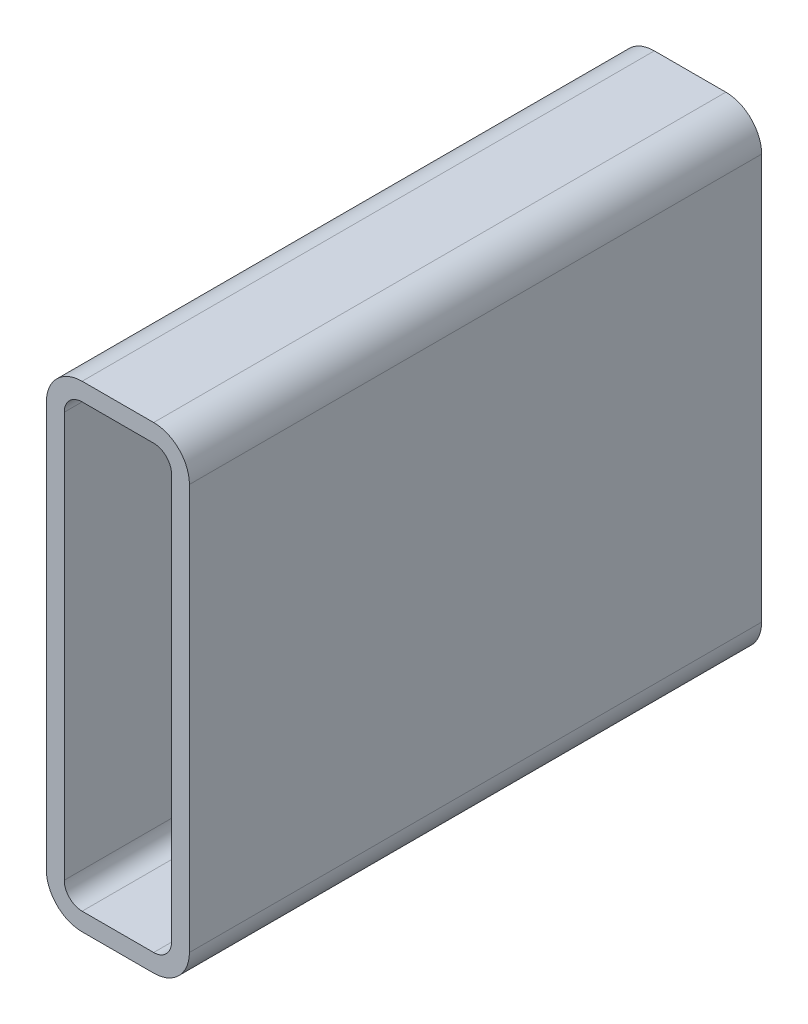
ISO-10303-21;
HEADER;
FILE_DESCRIPTION(('STEP AP214'),'2;1');
FILE_NAME('part.step','',(''),(''),'','','');
FILE_SCHEMA(('AUTOMOTIVE_DESIGN { 1 0 10303 214 1 1 1 1 }'));
ENDSEC;
DATA;
#1=APPLICATION_CONTEXT('core data for automotive mechanical design processes');
#2=APPLICATION_PROTOCOL_DEFINITION('international standard','automotive_design',2000,#1);
#3=PRODUCT_CONTEXT('',#1,'mechanical');
#4=PRODUCT('Part','Part','',(#3));
#5=PRODUCT_RELATED_PRODUCT_CATEGORY('part','',(#4));
#6=PRODUCT_DEFINITION_FORMATION('','',#4);
#7=PRODUCT_DEFINITION_CONTEXT('part definition',#1,'design');
#8=PRODUCT_DEFINITION('design','',#6,#7);
#9=PRODUCT_DEFINITION_SHAPE('','',#8);
#10=(LENGTH_UNIT() NAMED_UNIT(*) SI_UNIT(.MILLI.,.METRE.));
#11=(NAMED_UNIT(*) PLANE_ANGLE_UNIT() SI_UNIT($,.RADIAN.));
#12=(NAMED_UNIT(*) SI_UNIT($,.STERADIAN.) SOLID_ANGLE_UNIT());
#13=UNCERTAINTY_MEASURE_WITH_UNIT(LENGTH_MEASURE(1.E-05),#10,'distance_accuracy_value','');
#14=(GEOMETRIC_REPRESENTATION_CONTEXT(3) GLOBAL_UNCERTAINTY_ASSIGNED_CONTEXT((#13)) GLOBAL_UNIT_ASSIGNED_CONTEXT((#10,
#11,#12)) REPRESENTATION_CONTEXT('',''));
#15=CARTESIAN_POINT('',(0.,0.,0.));
#16=DIRECTION('',(0.,0.,1.));
#17=DIRECTION('',(1.,0.,0.));
#18=AXIS2_PLACEMENT_3D('',#15,#16,#17);
#19=CARTESIAN_POINT('',(21.5391160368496,236.870313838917,304.8));
#20=DIRECTION('',(0.,0.,1.));
#21=DIRECTION('',(1.,0.,0.));
#22=AXIS2_PLACEMENT_3D('',#19,#20,#21);
#23=PLANE('',#22);
#24=CARTESIAN_POINT('',(21.5391160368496,236.870313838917,304.8));
#25=DIRECTION('',(0.,0.,1.));
#26=DIRECTION('',(1.,0.,0.));
#27=AXIS2_PLACEMENT_3D('',#24,#25,#26);
#28=CIRCLE('',#27,19.05);
#29=CARTESIAN_POINT('',(21.5391160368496,255.920313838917,304.8));
#30=VERTEX_POINT('',#29);
#31=CARTESIAN_POINT('',(2.48911603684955,236.870313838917,304.8));
#32=VERTEX_POINT('',#31);
#33=EDGE_CURVE('E211',#30,#32,#28,.T.);
#34=ORIENTED_EDGE('',*,*,#33,.T.);
#35=DIRECTION('',(0.,-1.,0.));
#36=VECTOR('',#35,1.);
#37=CARTESIAN_POINT('',(2.48911603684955,20.9703138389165,304.8));
#38=LINE('',#37,#36);
#39=CARTESIAN_POINT('',(2.48911603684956,20.9703138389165,304.8));
#40=VERTEX_POINT('',#39);
#41=EDGE_CURVE('E214',#32,#40,#38,.T.);
#42=ORIENTED_EDGE('',*,*,#41,.T.);
#43=CARTESIAN_POINT('',(21.5391160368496,20.9703138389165,304.8));
#44=DIRECTION('',(0.,0.,1.));
#45=DIRECTION('',(1.,0.,0.));
#46=AXIS2_PLACEMENT_3D('',#43,#44,#45);
#47=CIRCLE('',#46,19.05);
#48=CARTESIAN_POINT('',(21.5391160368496,1.92031383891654,304.8));
#49=VERTEX_POINT('',#48);
#50=EDGE_CURVE('E217',#40,#49,#47,.T.);
#51=ORIENTED_EDGE('',*,*,#50,.T.);
#52=DIRECTION('',(1.,0.,0.));
#53=VECTOR('',#52,1.);
#54=CARTESIAN_POINT('',(59.6391160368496,1.92031383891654,304.8));
#55=LINE('',#54,#53);
#56=CARTESIAN_POINT('',(59.6391160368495,1.92031383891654,304.8));
#57=VERTEX_POINT('',#56);
#58=EDGE_CURVE('E219',#49,#57,#55,.T.);
#59=ORIENTED_EDGE('',*,*,#58,.T.);
#60=CARTESIAN_POINT('',(59.6391160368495,20.9703138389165,304.8));
#61=DIRECTION('',(0.,0.,1.));
#62=DIRECTION('',(1.,0.,0.));
#63=AXIS2_PLACEMENT_3D('',#60,#61,#62);
#64=CIRCLE('',#63,19.05);
#65=CARTESIAN_POINT('',(78.6891160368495,20.9703138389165,304.8));
#66=VERTEX_POINT('',#65);
#67=EDGE_CURVE('E221',#57,#66,#64,.T.);
#68=ORIENTED_EDGE('',*,*,#67,.T.);
#69=DIRECTION('',(0.,1.,0.));
#70=VECTOR('',#69,1.);
#71=CARTESIAN_POINT('',(78.6891160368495,236.870313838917,304.8));
#72=LINE('',#71,#70);
#73=CARTESIAN_POINT('',(78.6891160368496,236.870313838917,304.8));
#74=VERTEX_POINT('',#73);
#75=EDGE_CURVE('E223',#66,#74,#72,.T.);
#76=ORIENTED_EDGE('',*,*,#75,.T.);
#77=CARTESIAN_POINT('',(59.6391160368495,236.870313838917,304.8));
#78=DIRECTION('',(0.,0.,1.));
#79=DIRECTION('',(1.,0.,0.));
#80=AXIS2_PLACEMENT_3D('',#77,#78,#79);
#81=CIRCLE('',#80,19.05);
#82=CARTESIAN_POINT('',(59.6391160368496,255.920313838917,304.8));
#83=VERTEX_POINT('',#82);
#84=EDGE_CURVE('E225',#74,#83,#81,.T.);
#85=ORIENTED_EDGE('',*,*,#84,.T.);
#86=DIRECTION('',(-1.,0.,0.));
#87=VECTOR('',#86,1.);
#88=CARTESIAN_POINT('',(21.5391160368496,255.920313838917,304.8));
#89=LINE('',#88,#87);
#90=EDGE_CURVE('E227',#83,#30,#89,.T.);
#91=ORIENTED_EDGE('',*,*,#90,.T.);
#92=EDGE_LOOP('',(#34,#42,#51,#59,#68,#76,#85,#91));
#93=FACE_BOUND('',#92,.T.);
#94=DIRECTION('',(0.,-1.,0.));
#95=VECTOR('',#94,1.);
#96=CARTESIAN_POINT('',(12.0141160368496,20.9703138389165,304.8));
#97=LINE('',#96,#95);
#98=CARTESIAN_POINT('',(12.0141160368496,236.870313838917,304.8));
#99=VERTEX_POINT('',#98);
#100=CARTESIAN_POINT('',(12.0141160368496,20.9703138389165,304.8));
#101=VERTEX_POINT('',#100);
#102=EDGE_CURVE('E154',#99,#101,#97,.T.);
#103=ORIENTED_EDGE('',*,*,#102,.F.);
#104=CARTESIAN_POINT('',(21.5391160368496,236.870313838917,304.8));
#105=DIRECTION('',(0.,0.,1.));
#106=DIRECTION('',(1.,0.,0.));
#107=AXIS2_PLACEMENT_3D('',#104,#105,#106);
#108=CIRCLE('',#107,9.52500000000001);
#109=CARTESIAN_POINT('',(21.5391160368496,246.395313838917,304.8));
#110=VERTEX_POINT('',#109);
#111=EDGE_CURVE('E146',#110,#99,#108,.T.);
#112=ORIENTED_EDGE('',*,*,#111,.F.);
#113=DIRECTION('',(-1.,0.,0.));
#114=VECTOR('',#113,1.);
#115=CARTESIAN_POINT('',(21.5391160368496,246.395313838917,304.8));
#116=LINE('',#115,#114);
#117=CARTESIAN_POINT('',(59.6391160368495,246.395313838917,304.8));
#118=VERTEX_POINT('',#117);
#119=EDGE_CURVE('E179',#118,#110,#116,.T.);
#120=ORIENTED_EDGE('',*,*,#119,.F.);
#121=CARTESIAN_POINT('',(59.6391160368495,236.870313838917,304.8));
#122=DIRECTION('',(0.,0.,1.));
#123=DIRECTION('',(1.,0.,0.));
#124=AXIS2_PLACEMENT_3D('',#121,#122,#123);
#125=CIRCLE('',#124,9.52500000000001);
#126=CARTESIAN_POINT('',(69.1641160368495,236.870313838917,304.8));
#127=VERTEX_POINT('',#126);
#128=EDGE_CURVE('E177',#127,#118,#125,.T.);
#129=ORIENTED_EDGE('',*,*,#128,.F.);
#130=DIRECTION('',(0.,1.,0.));
#131=VECTOR('',#130,1.);
#132=CARTESIAN_POINT('',(69.1641160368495,236.870313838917,304.8));
#133=LINE('',#132,#131);
#134=CARTESIAN_POINT('',(69.1641160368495,20.9703138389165,304.8));
#135=VERTEX_POINT('',#134);
#136=EDGE_CURVE('E175',#135,#127,#133,.T.);
#137=ORIENTED_EDGE('',*,*,#136,.F.);
#138=CARTESIAN_POINT('',(59.6391160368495,20.9703138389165,304.8));
#139=DIRECTION('',(0.,0.,1.));
#140=DIRECTION('',(1.,0.,0.));
#141=AXIS2_PLACEMENT_3D('',#138,#139,#140);
#142=CIRCLE('',#141,9.525);
#143=CARTESIAN_POINT('',(59.6391160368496,11.4453138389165,304.8));
#144=VERTEX_POINT('',#143);
#145=EDGE_CURVE('E173',#144,#135,#142,.T.);
#146=ORIENTED_EDGE('',*,*,#145,.F.);
#147=DIRECTION('',(1.,0.,0.));
#148=VECTOR('',#147,1.);
#149=CARTESIAN_POINT('',(59.6391160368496,11.4453138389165,304.8));
#150=LINE('',#149,#148);
#151=CARTESIAN_POINT('',(21.5391160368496,11.4453138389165,304.8));
#152=VERTEX_POINT('',#151);
#153=EDGE_CURVE('E169',#152,#144,#150,.T.);
#154=ORIENTED_EDGE('',*,*,#153,.F.);
#155=CARTESIAN_POINT('',(21.5391160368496,20.9703138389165,304.8));
#156=DIRECTION('',(0.,0.,1.));
#157=DIRECTION('',(1.,0.,0.));
#158=AXIS2_PLACEMENT_3D('',#155,#156,#157);
#159=CIRCLE('',#158,9.525);
#160=EDGE_CURVE('E167',#101,#152,#159,.T.);
#161=ORIENTED_EDGE('',*,*,#160,.F.);
#162=EDGE_LOOP('',(#103,#112,#120,#129,#137,#146,#154,#161));
#163=FACE_BOUND('',#162,.T.);
#164=ADVANCED_FACE('F33',(#93,#163),#23,.T.);
#165=CARTESIAN_POINT('',(21.5391160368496,236.870313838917,0.));
#166=DIRECTION('',(0.,0.,1.));
#167=DIRECTION('',(1.,0.,0.));
#168=AXIS2_PLACEMENT_3D('',#165,#166,#167);
#169=PLANE('',#168);
#170=CARTESIAN_POINT('',(21.5391160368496,236.870313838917,0.));
#171=DIRECTION('',(0.,0.,1.));
#172=DIRECTION('',(1.,0.,0.));
#173=AXIS2_PLACEMENT_3D('',#170,#171,#172);
#174=CIRCLE('',#173,19.05);
#175=CARTESIAN_POINT('',(21.5391160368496,255.920313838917,0.));
#176=VERTEX_POINT('',#175);
#177=CARTESIAN_POINT('',(2.48911603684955,236.870313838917,0.));
#178=VERTEX_POINT('',#177);
#179=EDGE_CURVE('E162',#176,#178,#174,.T.);
#180=ORIENTED_EDGE('',*,*,#179,.F.);
#181=DIRECTION('',(-1.,0.,0.));
#182=VECTOR('',#181,1.);
#183=CARTESIAN_POINT('',(21.5391160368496,255.920313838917,0.));
#184=LINE('',#183,#182);
#185=CARTESIAN_POINT('',(59.6391160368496,255.920313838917,0.));
#186=VERTEX_POINT('',#185);
#187=EDGE_CURVE('E215',#186,#176,#184,.T.);
#188=ORIENTED_EDGE('',*,*,#187,.F.);
#189=CARTESIAN_POINT('',(59.6391160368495,236.870313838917,0.));
#190=DIRECTION('',(0.,0.,1.));
#191=DIRECTION('',(1.,0.,0.));
#192=AXIS2_PLACEMENT_3D('',#189,#190,#191);
#193=CIRCLE('',#192,19.05);
#194=CARTESIAN_POINT('',(78.6891160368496,236.870313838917,0.));
#195=VERTEX_POINT('',#194);
#196=EDGE_CURVE('E242',#195,#186,#193,.T.);
#197=ORIENTED_EDGE('',*,*,#196,.F.);
#198=DIRECTION('',(0.,1.,0.));
#199=VECTOR('',#198,1.);
#200=CARTESIAN_POINT('',(78.6891160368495,236.870313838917,0.));
#201=LINE('',#200,#199);
#202=CARTESIAN_POINT('',(78.6891160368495,20.9703138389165,0.));
#203=VERTEX_POINT('',#202);
#204=EDGE_CURVE('E240',#203,#195,#201,.T.);
#205=ORIENTED_EDGE('',*,*,#204,.F.);
#206=CARTESIAN_POINT('',(59.6391160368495,20.9703138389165,0.));
#207=DIRECTION('',(0.,0.,1.));
#208=DIRECTION('',(1.,0.,0.));
#209=AXIS2_PLACEMENT_3D('',#206,#207,#208);
#210=CIRCLE('',#209,19.05);
#211=CARTESIAN_POINT('',(59.6391160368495,1.92031383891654,0.));
#212=VERTEX_POINT('',#211);
#213=EDGE_CURVE('E238',#212,#203,#210,.T.);
#214=ORIENTED_EDGE('',*,*,#213,.F.);
#215=DIRECTION('',(1.,0.,0.));
#216=VECTOR('',#215,1.);
#217=CARTESIAN_POINT('',(59.6391160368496,1.92031383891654,0.));
#218=LINE('',#217,#216);
#219=CARTESIAN_POINT('',(21.5391160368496,1.92031383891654,0.));
#220=VERTEX_POINT('',#219);
#221=EDGE_CURVE('E236',#220,#212,#218,.T.);
#222=ORIENTED_EDGE('',*,*,#221,.F.);
#223=CARTESIAN_POINT('',(21.5391160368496,20.9703138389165,0.));
#224=DIRECTION('',(0.,0.,1.));
#225=DIRECTION('',(1.,0.,0.));
#226=AXIS2_PLACEMENT_3D('',#223,#224,#225);
#227=CIRCLE('',#226,19.05);
#228=CARTESIAN_POINT('',(2.48911603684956,20.9703138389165,0.));
#229=VERTEX_POINT('',#228);
#230=EDGE_CURVE('E234',#229,#220,#227,.T.);
#231=ORIENTED_EDGE('',*,*,#230,.F.);
#232=DIRECTION('',(0.,-1.,0.));
#233=VECTOR('',#232,1.);
#234=CARTESIAN_POINT('',(2.48911603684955,20.9703138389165,0.));
#235=LINE('',#234,#233);
#236=EDGE_CURVE('E232',#178,#229,#235,.T.);
#237=ORIENTED_EDGE('',*,*,#236,.F.);
#238=EDGE_LOOP('',(#180,#188,#197,#205,#214,#222,#231,#237));
#239=FACE_BOUND('',#238,.T.);
#240=CARTESIAN_POINT('',(21.5391160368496,236.870313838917,0.));
#241=DIRECTION('',(0.,0.,1.));
#242=DIRECTION('',(1.,0.,0.));
#243=AXIS2_PLACEMENT_3D('',#240,#241,#242);
#244=CIRCLE('',#243,9.52500000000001);
#245=CARTESIAN_POINT('',(21.5391160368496,246.395313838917,0.));
#246=VERTEX_POINT('',#245);
#247=CARTESIAN_POINT('',(12.0141160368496,236.870313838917,0.));
#248=VERTEX_POINT('',#247);
#249=EDGE_CURVE('E56',#246,#248,#244,.T.);
#250=ORIENTED_EDGE('',*,*,#249,.T.);
#251=DIRECTION('',(0.,-1.,0.));
#252=VECTOR('',#251,1.);
#253=CARTESIAN_POINT('',(12.0141160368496,20.9703138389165,0.));
#254=LINE('',#253,#252);
#255=CARTESIAN_POINT('',(12.0141160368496,20.9703138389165,0.));
#256=VERTEX_POINT('',#255);
#257=EDGE_CURVE('E161',#248,#256,#254,.T.);
#258=ORIENTED_EDGE('',*,*,#257,.T.);
#259=CARTESIAN_POINT('',(21.5391160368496,20.9703138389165,0.));
#260=DIRECTION('',(0.,0.,1.));
#261=DIRECTION('',(1.,0.,0.));
#262=AXIS2_PLACEMENT_3D('',#259,#260,#261);
#263=CIRCLE('',#262,9.525);
#264=CARTESIAN_POINT('',(21.5391160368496,11.4453138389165,0.));
#265=VERTEX_POINT('',#264);
#266=EDGE_CURVE('E183',#256,#265,#263,.T.);
#267=ORIENTED_EDGE('',*,*,#266,.T.);
#268=DIRECTION('',(1.,0.,0.));
#269=VECTOR('',#268,1.);
#270=CARTESIAN_POINT('',(59.6391160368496,11.4453138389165,0.));
#271=LINE('',#270,#269);
#272=CARTESIAN_POINT('',(59.6391160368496,11.4453138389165,0.));
#273=VERTEX_POINT('',#272);
#274=EDGE_CURVE('E186',#265,#273,#271,.T.);
#275=ORIENTED_EDGE('',*,*,#274,.T.);
#276=CARTESIAN_POINT('',(59.6391160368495,20.9703138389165,0.));
#277=DIRECTION('',(0.,0.,1.));
#278=DIRECTION('',(1.,0.,0.));
#279=AXIS2_PLACEMENT_3D('',#276,#277,#278);
#280=CIRCLE('',#279,9.525);
#281=CARTESIAN_POINT('',(69.1641160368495,20.9703138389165,0.));
#282=VERTEX_POINT('',#281);
#283=EDGE_CURVE('E189',#273,#282,#280,.T.);
#284=ORIENTED_EDGE('',*,*,#283,.T.);
#285=DIRECTION('',(0.,1.,0.));
#286=VECTOR('',#285,1.);
#287=CARTESIAN_POINT('',(69.1641160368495,236.870313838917,0.));
#288=LINE('',#287,#286);
#289=CARTESIAN_POINT('',(69.1641160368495,236.870313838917,0.));
#290=VERTEX_POINT('',#289);
#291=EDGE_CURVE('E192',#282,#290,#288,.T.);
#292=ORIENTED_EDGE('',*,*,#291,.T.);
#293=CARTESIAN_POINT('',(59.6391160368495,236.870313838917,0.));
#294=DIRECTION('',(0.,0.,1.));
#295=DIRECTION('',(1.,0.,0.));
#296=AXIS2_PLACEMENT_3D('',#293,#294,#295);
#297=CIRCLE('',#296,9.52500000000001);
#298=CARTESIAN_POINT('',(59.6391160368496,246.395313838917,0.));
#299=VERTEX_POINT('',#298);
#300=EDGE_CURVE('E195',#290,#299,#297,.T.);
#301=ORIENTED_EDGE('',*,*,#300,.T.);
#302=DIRECTION('',(-1.,0.,0.));
#303=VECTOR('',#302,1.);
#304=CARTESIAN_POINT('',(21.5391160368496,246.395313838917,0.));
#305=LINE('',#304,#303);
#306=EDGE_CURVE('E155',#299,#246,#305,.T.);
#307=ORIENTED_EDGE('',*,*,#306,.T.);
#308=EDGE_LOOP('',(#250,#258,#267,#275,#284,#292,#301,#307));
#309=FACE_BOUND('',#308,.T.);
#310=ADVANCED_FACE('F272',(#239,#309),#169,.F.);
#311=CARTESIAN_POINT('',(21.5391160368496,236.870313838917,304.8));
#312=DIRECTION('',(0.,0.,-1.));
#313=DIRECTION('',(-1.,0.,0.));
#314=AXIS2_PLACEMENT_3D('',#311,#312,#313);
#315=CYLINDRICAL_SURFACE('',#314,19.05);
#316=ORIENTED_EDGE('',*,*,#179,.T.);
#317=DIRECTION('',(0.,0.,-1.));
#318=VECTOR('',#317,1.);
#319=CARTESIAN_POINT('',(2.48911603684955,236.870313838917,304.8));
#320=LINE('',#319,#318);
#321=EDGE_CURVE('E11',#32,#178,#320,.T.);
#322=ORIENTED_EDGE('',*,*,#321,.F.);
#323=ORIENTED_EDGE('',*,*,#33,.F.);
#324=DIRECTION('',(0.,0.,-1.));
#325=VECTOR('',#324,1.);
#326=CARTESIAN_POINT('',(21.5391160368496,255.920313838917,304.8));
#327=LINE('',#326,#325);
#328=EDGE_CURVE('E229',#30,#176,#327,.T.);
#329=ORIENTED_EDGE('',*,*,#328,.T.);
#330=EDGE_LOOP('',(#316,#322,#323,#329));
#331=FACE_BOUND('',#330,.T.);
#332=ADVANCED_FACE('F35',(#331),#315,.T.);
#333=CARTESIAN_POINT('',(2.48911603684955,20.9703138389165,304.8));
#334=DIRECTION('',(1.,0.,0.));
#335=DIRECTION('',(0.,0.,-1.));
#336=AXIS2_PLACEMENT_3D('',#333,#334,#335);
#337=PLANE('',#336);
#338=ORIENTED_EDGE('',*,*,#236,.T.);
#339=DIRECTION('',(0.,0.,-1.));
#340=VECTOR('',#339,1.);
#341=CARTESIAN_POINT('',(2.48911603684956,20.9703138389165,304.8));
#342=LINE('',#341,#340);
#343=EDGE_CURVE('E41',#40,#229,#342,.T.);
#344=ORIENTED_EDGE('',*,*,#343,.F.);
#345=ORIENTED_EDGE('',*,*,#41,.F.);
#346=ORIENTED_EDGE('',*,*,#321,.T.);
#347=EDGE_LOOP('',(#338,#344,#345,#346));
#348=FACE_BOUND('',#347,.T.);
#349=ADVANCED_FACE('F289',(#348),#337,.F.);
#350=CARTESIAN_POINT('',(21.5391160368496,20.9703138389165,304.8));
#351=DIRECTION('',(0.,0.,-1.));
#352=DIRECTION('',(-1.,0.,0.));
#353=AXIS2_PLACEMENT_3D('',#350,#351,#352);
#354=CYLINDRICAL_SURFACE('',#353,19.05);
#355=ORIENTED_EDGE('',*,*,#230,.T.);
#356=DIRECTION('',(0.,0.,-1.));
#357=VECTOR('',#356,1.);
#358=CARTESIAN_POINT('',(21.5391160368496,1.92031383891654,304.8));
#359=LINE('',#358,#357);
#360=EDGE_CURVE('E259',#49,#220,#359,.T.);
#361=ORIENTED_EDGE('',*,*,#360,.F.);
#362=ORIENTED_EDGE('',*,*,#50,.F.);
#363=ORIENTED_EDGE('',*,*,#343,.T.);
#364=EDGE_LOOP('',(#355,#361,#362,#363));
#365=FACE_BOUND('',#364,.T.);
#366=ADVANCED_FACE('F266',(#365),#354,.T.);
#367=CARTESIAN_POINT('',(59.6391160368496,1.92031383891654,304.8));
#368=DIRECTION('',(0.,1.,0.));
#369=DIRECTION('',(0.,0.,1.));
#370=AXIS2_PLACEMENT_3D('',#367,#368,#369);
#371=PLANE('',#370);
#372=ORIENTED_EDGE('',*,*,#221,.T.);
#373=DIRECTION('',(0.,0.,-1.));
#374=VECTOR('',#373,1.);
#375=CARTESIAN_POINT('',(59.6391160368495,1.92031383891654,304.8));
#376=LINE('',#375,#374);
#377=EDGE_CURVE('E256',#57,#212,#376,.T.);
#378=ORIENTED_EDGE('',*,*,#377,.F.);
#379=ORIENTED_EDGE('',*,*,#58,.F.);
#380=ORIENTED_EDGE('',*,*,#360,.T.);
#381=EDGE_LOOP('',(#372,#378,#379,#380));
#382=FACE_BOUND('',#381,.T.);
#383=ADVANCED_FACE('F278',(#382),#371,.F.);
#384=CARTESIAN_POINT('',(59.6391160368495,20.9703138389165,304.8));
#385=DIRECTION('',(0.,0.,-1.));
#386=DIRECTION('',(-1.,0.,0.));
#387=AXIS2_PLACEMENT_3D('',#384,#385,#386);
#388=CYLINDRICAL_SURFACE('',#387,19.05);
#389=ORIENTED_EDGE('',*,*,#213,.T.);
#390=DIRECTION('',(0.,0.,-1.));
#391=VECTOR('',#390,1.);
#392=CARTESIAN_POINT('',(78.6891160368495,20.9703138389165,304.8));
#393=LINE('',#392,#391);
#394=EDGE_CURVE('E253',#66,#203,#393,.T.);
#395=ORIENTED_EDGE('',*,*,#394,.F.);
#396=ORIENTED_EDGE('',*,*,#67,.F.);
#397=ORIENTED_EDGE('',*,*,#377,.T.);
#398=EDGE_LOOP('',(#389,#395,#396,#397));
#399=FACE_BOUND('',#398,.T.);
#400=ADVANCED_FACE('F282',(#399),#388,.T.);
#401=CARTESIAN_POINT('',(78.6891160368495,236.870313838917,304.8));
#402=DIRECTION('',(-1.,0.,0.));
#403=DIRECTION('',(0.,0.,1.));
#404=AXIS2_PLACEMENT_3D('',#401,#402,#403);
#405=PLANE('',#404);
#406=ORIENTED_EDGE('',*,*,#204,.T.);
#407=DIRECTION('',(0.,0.,-1.));
#408=VECTOR('',#407,1.);
#409=CARTESIAN_POINT('',(78.6891160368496,236.870313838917,304.8));
#410=LINE('',#409,#408);
#411=EDGE_CURVE('E250',#74,#195,#410,.T.);
#412=ORIENTED_EDGE('',*,*,#411,.F.);
#413=ORIENTED_EDGE('',*,*,#75,.F.);
#414=ORIENTED_EDGE('',*,*,#394,.T.);
#415=EDGE_LOOP('',(#406,#412,#413,#414));
#416=FACE_BOUND('',#415,.T.);
#417=ADVANCED_FACE('F302',(#416),#405,.F.);
#418=CARTESIAN_POINT('',(59.6391160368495,236.870313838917,304.8));
#419=DIRECTION('',(0.,0.,-1.));
#420=DIRECTION('',(-1.,0.,0.));
#421=AXIS2_PLACEMENT_3D('',#418,#419,#420);
#422=CYLINDRICAL_SURFACE('',#421,19.05);
#423=ORIENTED_EDGE('',*,*,#196,.T.);
#424=DIRECTION('',(0.,0.,-1.));
#425=VECTOR('',#424,1.);
#426=CARTESIAN_POINT('',(59.6391160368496,255.920313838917,304.8));
#427=LINE('',#426,#425);
#428=EDGE_CURVE('E247',#83,#186,#427,.T.);
#429=ORIENTED_EDGE('',*,*,#428,.F.);
#430=ORIENTED_EDGE('',*,*,#84,.F.);
#431=ORIENTED_EDGE('',*,*,#411,.T.);
#432=EDGE_LOOP('',(#423,#429,#430,#431));
#433=FACE_BOUND('',#432,.T.);
#434=ADVANCED_FACE('F300',(#433),#422,.T.);
#435=CARTESIAN_POINT('',(21.5391160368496,255.920313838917,304.8));
#436=DIRECTION('',(0.,-1.,0.));
#437=DIRECTION('',(0.,0.,-1.));
#438=AXIS2_PLACEMENT_3D('',#435,#436,#437);
#439=PLANE('',#438);
#440=ORIENTED_EDGE('',*,*,#187,.T.);
#441=ORIENTED_EDGE('',*,*,#328,.F.);
#442=ORIENTED_EDGE('',*,*,#90,.F.);
#443=ORIENTED_EDGE('',*,*,#428,.T.);
#444=EDGE_LOOP('',(#440,#441,#442,#443));
#445=FACE_BOUND('',#444,.T.);
#446=ADVANCED_FACE('F295',(#445),#439,.F.);
#447=CARTESIAN_POINT('',(21.5391160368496,236.870313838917,304.8));
#448=DIRECTION('',(0.,0.,-1.));
#449=DIRECTION('',(-1.,0.,0.));
#450=AXIS2_PLACEMENT_3D('',#447,#448,#449);
#451=CYLINDRICAL_SURFACE('',#450,9.52500000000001);
#452=ORIENTED_EDGE('',*,*,#249,.F.);
#453=DIRECTION('',(0.,0.,-1.));
#454=VECTOR('',#453,1.);
#455=CARTESIAN_POINT('',(21.5391160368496,246.395313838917,304.8));
#456=LINE('',#455,#454);
#457=EDGE_CURVE('E150',#110,#246,#456,.T.);
#458=ORIENTED_EDGE('',*,*,#457,.F.);
#459=ORIENTED_EDGE('',*,*,#111,.T.);
#460=DIRECTION('',(0.,0.,-1.));
#461=VECTOR('',#460,1.);
#462=CARTESIAN_POINT('',(12.0141160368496,236.870313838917,304.8));
#463=LINE('',#462,#461);
#464=EDGE_CURVE('E149',#99,#248,#463,.T.);
#465=ORIENTED_EDGE('',*,*,#464,.T.);
#466=EDGE_LOOP('',(#452,#458,#459,#465));
#467=FACE_BOUND('',#466,.T.);
#468=ADVANCED_FACE('F148',(#467),#451,.F.);
#469=CARTESIAN_POINT('',(12.0141160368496,20.9703138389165,304.8));
#470=DIRECTION('',(1.,0.,0.));
#471=DIRECTION('',(0.,0.,-1.));
#472=AXIS2_PLACEMENT_3D('',#469,#470,#471);
#473=PLANE('',#472);
#474=ORIENTED_EDGE('',*,*,#257,.F.);
#475=ORIENTED_EDGE('',*,*,#464,.F.);
#476=ORIENTED_EDGE('',*,*,#102,.T.);
#477=DIRECTION('',(0.,0.,-1.));
#478=VECTOR('',#477,1.);
#479=CARTESIAN_POINT('',(12.0141160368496,20.9703138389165,304.8));
#480=LINE('',#479,#478);
#481=EDGE_CURVE('E163',#101,#256,#480,.T.);
#482=ORIENTED_EDGE('',*,*,#481,.T.);
#483=EDGE_LOOP('',(#474,#475,#476,#482));
#484=FACE_BOUND('',#483,.T.);
#485=ADVANCED_FACE('F158',(#484),#473,.T.);
#486=CARTESIAN_POINT('',(21.5391160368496,20.9703138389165,304.8));
#487=DIRECTION('',(0.,0.,-1.));
#488=DIRECTION('',(-1.,0.,0.));
#489=AXIS2_PLACEMENT_3D('',#486,#487,#488);
#490=CYLINDRICAL_SURFACE('',#489,9.525);
#491=ORIENTED_EDGE('',*,*,#266,.F.);
#492=ORIENTED_EDGE('',*,*,#481,.F.);
#493=ORIENTED_EDGE('',*,*,#160,.T.);
#494=DIRECTION('',(0.,0.,-1.));
#495=VECTOR('',#494,1.);
#496=CARTESIAN_POINT('',(21.5391160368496,11.4453138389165,304.8));
#497=LINE('',#496,#495);
#498=EDGE_CURVE('E208',#152,#265,#497,.T.);
#499=ORIENTED_EDGE('',*,*,#498,.T.);
#500=EDGE_LOOP('',(#491,#492,#493,#499));
#501=FACE_BOUND('',#500,.T.);
#502=ADVANCED_FACE('F327',(#501),#490,.F.);
#503=CARTESIAN_POINT('',(59.6391160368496,11.4453138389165,304.8));
#504=DIRECTION('',(0.,1.,0.));
#505=DIRECTION('',(0.,0.,1.));
#506=AXIS2_PLACEMENT_3D('',#503,#504,#505);
#507=PLANE('',#506);
#508=ORIENTED_EDGE('',*,*,#274,.F.);
#509=ORIENTED_EDGE('',*,*,#498,.F.);
#510=ORIENTED_EDGE('',*,*,#153,.T.);
#511=DIRECTION('',(0.,0.,-1.));
#512=VECTOR('',#511,1.);
#513=CARTESIAN_POINT('',(59.6391160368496,11.4453138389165,304.8));
#514=LINE('',#513,#512);
#515=EDGE_CURVE('E206',#144,#273,#514,.T.);
#516=ORIENTED_EDGE('',*,*,#515,.T.);
#517=EDGE_LOOP('',(#508,#509,#510,#516));
#518=FACE_BOUND('',#517,.T.);
#519=ADVANCED_FACE('F331',(#518),#507,.T.);
#520=CARTESIAN_POINT('',(59.6391160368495,20.9703138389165,304.8));
#521=DIRECTION('',(0.,0.,-1.));
#522=DIRECTION('',(-1.,0.,0.));
#523=AXIS2_PLACEMENT_3D('',#520,#521,#522);
#524=CYLINDRICAL_SURFACE('',#523,9.525);
#525=ORIENTED_EDGE('',*,*,#283,.F.);
#526=ORIENTED_EDGE('',*,*,#515,.F.);
#527=ORIENTED_EDGE('',*,*,#145,.T.);
#528=DIRECTION('',(0.,0.,-1.));
#529=VECTOR('',#528,1.);
#530=CARTESIAN_POINT('',(69.1641160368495,20.9703138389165,304.8));
#531=LINE('',#530,#529);
#532=EDGE_CURVE('E204',#135,#282,#531,.T.);
#533=ORIENTED_EDGE('',*,*,#532,.T.);
#534=EDGE_LOOP('',(#525,#526,#527,#533));
#535=FACE_BOUND('',#534,.T.);
#536=ADVANCED_FACE('F337',(#535),#524,.F.);
#537=CARTESIAN_POINT('',(69.1641160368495,236.870313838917,304.8));
#538=DIRECTION('',(-1.,0.,0.));
#539=DIRECTION('',(0.,0.,1.));
#540=AXIS2_PLACEMENT_3D('',#537,#538,#539);
#541=PLANE('',#540);
#542=ORIENTED_EDGE('',*,*,#291,.F.);
#543=ORIENTED_EDGE('',*,*,#532,.F.);
#544=ORIENTED_EDGE('',*,*,#136,.T.);
#545=DIRECTION('',(0.,0.,-1.));
#546=VECTOR('',#545,1.);
#547=CARTESIAN_POINT('',(69.1641160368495,236.870313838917,304.8));
#548=LINE('',#547,#546);
#549=EDGE_CURVE('E202',#127,#290,#548,.T.);
#550=ORIENTED_EDGE('',*,*,#549,.T.);
#551=EDGE_LOOP('',(#542,#543,#544,#550));
#552=FACE_BOUND('',#551,.T.);
#553=ADVANCED_FACE('F341',(#552),#541,.T.);
#554=CARTESIAN_POINT('',(59.6391160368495,236.870313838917,304.8));
#555=DIRECTION('',(0.,0.,-1.));
#556=DIRECTION('',(-1.,0.,0.));
#557=AXIS2_PLACEMENT_3D('',#554,#555,#556);
#558=CYLINDRICAL_SURFACE('',#557,9.52500000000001);
#559=ORIENTED_EDGE('',*,*,#300,.F.);
#560=ORIENTED_EDGE('',*,*,#549,.F.);
#561=ORIENTED_EDGE('',*,*,#128,.T.);
#562=DIRECTION('',(0.,0.,-1.));
#563=VECTOR('',#562,1.);
#564=CARTESIAN_POINT('',(59.6391160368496,246.395313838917,304.8));
#565=LINE('',#564,#563);
#566=EDGE_CURVE('E48',#118,#299,#565,.T.);
#567=ORIENTED_EDGE('',*,*,#566,.T.);
#568=EDGE_LOOP('',(#559,#560,#561,#567));
#569=FACE_BOUND('',#568,.T.);
#570=ADVANCED_FACE('F345',(#569),#558,.F.);
#571=CARTESIAN_POINT('',(21.5391160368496,246.395313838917,304.8));
#572=DIRECTION('',(0.,-1.,0.));
#573=DIRECTION('',(0.,0.,-1.));
#574=AXIS2_PLACEMENT_3D('',#571,#572,#573);
#575=PLANE('',#574);
#576=ORIENTED_EDGE('',*,*,#306,.F.);
#577=ORIENTED_EDGE('',*,*,#566,.F.);
#578=ORIENTED_EDGE('',*,*,#119,.T.);
#579=ORIENTED_EDGE('',*,*,#457,.T.);
#580=EDGE_LOOP('',(#576,#577,#578,#579));
#581=FACE_BOUND('',#580,.T.);
#582=ADVANCED_FACE('F349',(#581),#575,.T.);
#583=CLOSED_SHELL('',(#164,#310,#332,#349,#366,#383,#400,#417,#434,#446,#468,#485,#502,#519,
#536,#553,#570,#582));
#584=MANIFOLD_SOLID_BREP('B2',#583);
#585=ADVANCED_BREP_SHAPE_REPRESENTATION('',(#18,#584),#14);
#586=SHAPE_DEFINITION_REPRESENTATION(#9,#585);
ENDSEC;
END-ISO-10303-21;
